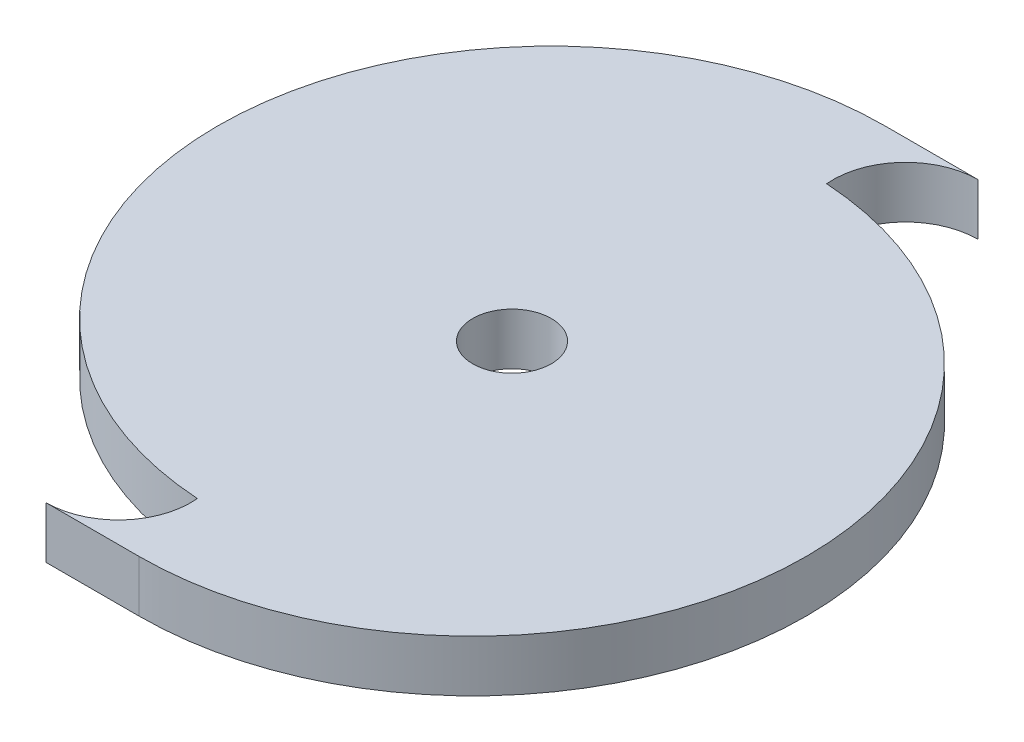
ISO-10303-21;
HEADER;
FILE_DESCRIPTION(('STEP AP214'),'2;1');
FILE_NAME('part.step','',(''),(''),'','','');
FILE_SCHEMA(('AUTOMOTIVE_DESIGN { 1 0 10303 214 1 1 1 1 }'));
ENDSEC;
DATA;
#1=APPLICATION_CONTEXT('core data for automotive mechanical design processes');
#2=APPLICATION_PROTOCOL_DEFINITION('international standard','automotive_design',2000,#1);
#3=PRODUCT_CONTEXT('',#1,'mechanical');
#4=PRODUCT('Part','Part','',(#3));
#5=PRODUCT_RELATED_PRODUCT_CATEGORY('part','',(#4));
#6=PRODUCT_DEFINITION_FORMATION('','',#4);
#7=PRODUCT_DEFINITION_CONTEXT('part definition',#1,'design');
#8=PRODUCT_DEFINITION('design','',#6,#7);
#9=PRODUCT_DEFINITION_SHAPE('','',#8);
#10=(LENGTH_UNIT() NAMED_UNIT(*) SI_UNIT(.MILLI.,.METRE.));
#11=(NAMED_UNIT(*) PLANE_ANGLE_UNIT() SI_UNIT($,.RADIAN.));
#12=(NAMED_UNIT(*) SI_UNIT($,.STERADIAN.) SOLID_ANGLE_UNIT());
#13=UNCERTAINTY_MEASURE_WITH_UNIT(LENGTH_MEASURE(1.E-05),#10,'distance_accuracy_value','');
#14=(GEOMETRIC_REPRESENTATION_CONTEXT(3) GLOBAL_UNCERTAINTY_ASSIGNED_CONTEXT((#13)) GLOBAL_UNIT_ASSIGNED_CONTEXT((#10,
#11,#12)) REPRESENTATION_CONTEXT('',''));
#15=CARTESIAN_POINT('',(0.,0.,0.));
#16=DIRECTION('',(0.,0.,1.));
#17=DIRECTION('',(1.,0.,0.));
#18=AXIS2_PLACEMENT_3D('',#15,#16,#17);
#19=CARTESIAN_POINT('',(18.,10.,-58.1));
#20=DIRECTION('',(0.,1.,0.));
#21=DIRECTION('',(0.,0.,1.));
#22=AXIS2_PLACEMENT_3D('',#19,#20,#21);
#23=PLANE('',#22);
#24=CARTESIAN_POINT('',(18.,10.,-58.1));
#25=DIRECTION('',(0.,-1.,0.));
#26=DIRECTION('',(0.,0.,1.));
#27=AXIS2_PLACEMENT_3D('',#24,#25,#26);
#28=CIRCLE('',#27,14.);
#29=CARTESIAN_POINT('',(4.06313743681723,10.,-56.7718953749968));
#30=VERTEX_POINT('',#29);
#31=CARTESIAN_POINT('',(18.,10.,-72.1));
#32=VERTEX_POINT('',#31);
#33=EDGE_CURVE('E129',#30,#32,#28,.T.);
#34=ORIENTED_EDGE('',*,*,#33,.T.);
#35=DIRECTION('',(-1.,0.,0.));
#36=VECTOR('',#35,1.);
#37=CARTESIAN_POINT('',(0.,10.,-72.1));
#38=LINE('',#37,#36);
#39=CARTESIAN_POINT('',(0.,10.,-72.1));
#40=VERTEX_POINT('',#39);
#41=EDGE_CURVE('E87',#32,#40,#38,.T.);
#42=ORIENTED_EDGE('',*,*,#41,.T.);
#43=CARTESIAN_POINT('',(0.,10.,-7.6));
#44=DIRECTION('',(0.,1.,0.));
#45=DIRECTION('',(0.,0.,1.));
#46=AXIS2_PLACEMENT_3D('',#43,#44,#45);
#47=CIRCLE('',#46,64.5);
#48=CARTESIAN_POINT('',(-4.06313743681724,10.,56.7718953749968));
#49=VERTEX_POINT('',#48);
#50=EDGE_CURVE('E100',#40,#49,#47,.T.);
#51=ORIENTED_EDGE('',*,*,#50,.T.);
#52=CARTESIAN_POINT('',(-18.,10.,58.1));
#53=DIRECTION('',(0.,-1.,0.));
#54=DIRECTION('',(0.,0.,1.));
#55=AXIS2_PLACEMENT_3D('',#52,#53,#54);
#56=CIRCLE('',#55,14.);
#57=CARTESIAN_POINT('',(-18.,10.,72.1));
#58=VERTEX_POINT('',#57);
#59=EDGE_CURVE('E94',#49,#58,#56,.T.);
#60=ORIENTED_EDGE('',*,*,#59,.T.);
#61=DIRECTION('',(1.,0.,0.));
#62=VECTOR('',#61,1.);
#63=CARTESIAN_POINT('',(0.,10.,72.1));
#64=LINE('',#63,#62);
#65=CARTESIAN_POINT('',(0.,10.,72.1));
#66=VERTEX_POINT('',#65);
#67=EDGE_CURVE('E98',#58,#66,#64,.T.);
#68=ORIENTED_EDGE('',*,*,#67,.T.);
#69=CARTESIAN_POINT('',(0.,10.,7.6));
#70=DIRECTION('',(0.,1.,0.));
#71=DIRECTION('',(0.,0.,1.));
#72=AXIS2_PLACEMENT_3D('',#69,#70,#71);
#73=CIRCLE('',#72,64.5);
#74=EDGE_CURVE('E50',#66,#30,#73,.T.);
#75=ORIENTED_EDGE('',*,*,#74,.T.);
#76=EDGE_LOOP('',(#34,#42,#51,#60,#68,#75));
#77=FACE_BOUND('',#76,.T.);
#78=CARTESIAN_POINT('',(0.,10.,0.));
#79=DIRECTION('',(0.,1.,0.));
#80=DIRECTION('',(0.,0.,1.));
#81=AXIS2_PLACEMENT_3D('',#78,#79,#80);
#82=CIRCLE('',#81,7.6);
#83=CARTESIAN_POINT('',(0.,10.,7.6));
#84=VERTEX_POINT('',#83);
#85=EDGE_CURVE('E122',#84,#84,#82,.T.);
#86=ORIENTED_EDGE('',*,*,#85,.F.);
#87=EDGE_LOOP('',(#86));
#88=FACE_BOUND('',#87,.T.);
#89=ADVANCED_FACE('F33',(#77,#88),#23,.T.);
#90=CARTESIAN_POINT('',(18.,0.,-58.1));
#91=DIRECTION('',(0.,1.,0.));
#92=DIRECTION('',(0.,0.,1.));
#93=AXIS2_PLACEMENT_3D('',#90,#91,#92);
#94=PLANE('',#93);
#95=CARTESIAN_POINT('',(18.,0.,-58.1));
#96=DIRECTION('',(0.,-1.,0.));
#97=DIRECTION('',(0.,0.,1.));
#98=AXIS2_PLACEMENT_3D('',#95,#96,#97);
#99=CIRCLE('',#98,14.);
#100=CARTESIAN_POINT('',(4.06313743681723,0.,-56.7718953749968));
#101=VERTEX_POINT('',#100);
#102=CARTESIAN_POINT('',(18.,0.,-72.1));
#103=VERTEX_POINT('',#102);
#104=EDGE_CURVE('E118',#101,#103,#99,.T.);
#105=ORIENTED_EDGE('',*,*,#104,.F.);
#106=CARTESIAN_POINT('',(0.,0.,7.6));
#107=DIRECTION('',(0.,1.,0.));
#108=DIRECTION('',(0.,0.,1.));
#109=AXIS2_PLACEMENT_3D('',#106,#107,#108);
#110=CIRCLE('',#109,64.5);
#111=CARTESIAN_POINT('',(0.,0.,72.1));
#112=VERTEX_POINT('',#111);
#113=EDGE_CURVE('E79',#112,#101,#110,.T.);
#114=ORIENTED_EDGE('',*,*,#113,.F.);
#115=DIRECTION('',(1.,0.,0.));
#116=VECTOR('',#115,1.);
#117=CARTESIAN_POINT('',(0.,0.,72.1));
#118=LINE('',#117,#116);
#119=CARTESIAN_POINT('',(-18.,0.,72.1));
#120=VERTEX_POINT('',#119);
#121=EDGE_CURVE('E73',#120,#112,#118,.T.);
#122=ORIENTED_EDGE('',*,*,#121,.F.);
#123=CARTESIAN_POINT('',(-18.,0.,58.1));
#124=DIRECTION('',(0.,-1.,0.));
#125=DIRECTION('',(0.,0.,1.));
#126=AXIS2_PLACEMENT_3D('',#123,#124,#125);
#127=CIRCLE('',#126,14.);
#128=CARTESIAN_POINT('',(-4.06313743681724,0.,56.7718953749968));
#129=VERTEX_POINT('',#128);
#130=EDGE_CURVE('E108',#129,#120,#127,.T.);
#131=ORIENTED_EDGE('',*,*,#130,.F.);
#132=CARTESIAN_POINT('',(0.,0.,-7.6));
#133=DIRECTION('',(0.,1.,0.));
#134=DIRECTION('',(0.,0.,1.));
#135=AXIS2_PLACEMENT_3D('',#132,#133,#134);
#136=CIRCLE('',#135,64.5);
#137=CARTESIAN_POINT('',(0.,0.,-72.1));
#138=VERTEX_POINT('',#137);
#139=EDGE_CURVE('E124',#138,#129,#136,.T.);
#140=ORIENTED_EDGE('',*,*,#139,.F.);
#141=DIRECTION('',(-1.,0.,0.));
#142=VECTOR('',#141,1.);
#143=CARTESIAN_POINT('',(0.,0.,-72.1));
#144=LINE('',#143,#142);
#145=EDGE_CURVE('E121',#103,#138,#144,.T.);
#146=ORIENTED_EDGE('',*,*,#145,.F.);
#147=EDGE_LOOP('',(#105,#114,#122,#131,#140,#146));
#148=FACE_BOUND('',#147,.T.);
#149=CARTESIAN_POINT('',(0.,0.,0.));
#150=DIRECTION('',(0.,1.,0.));
#151=DIRECTION('',(0.,0.,1.));
#152=AXIS2_PLACEMENT_3D('',#149,#150,#151);
#153=CIRCLE('',#152,7.6);
#154=CARTESIAN_POINT('',(0.,0.,7.6));
#155=VERTEX_POINT('',#154);
#156=EDGE_CURVE('E222',#155,#155,#153,.T.);
#157=ORIENTED_EDGE('',*,*,#156,.T.);
#158=EDGE_LOOP('',(#157));
#159=FACE_BOUND('',#158,.T.);
#160=ADVANCED_FACE('F138',(#148,#159),#94,.F.);
#161=CARTESIAN_POINT('',(18.,10.,-58.1));
#162=DIRECTION('',(0.,-1.,0.));
#163=DIRECTION('',(0.,0.,-1.));
#164=AXIS2_PLACEMENT_3D('',#161,#162,#163);
#165=CYLINDRICAL_SURFACE('',#164,14.);
#166=ORIENTED_EDGE('',*,*,#104,.T.);
#167=DIRECTION('',(0.,-1.,0.));
#168=VECTOR('',#167,1.);
#169=CARTESIAN_POINT('',(18.,10.,-72.1));
#170=LINE('',#169,#168);
#171=EDGE_CURVE('E11',#32,#103,#170,.T.);
#172=ORIENTED_EDGE('',*,*,#171,.F.);
#173=ORIENTED_EDGE('',*,*,#33,.F.);
#174=DIRECTION('',(0.,-1.,0.));
#175=VECTOR('',#174,1.);
#176=CARTESIAN_POINT('',(4.06313743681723,10.,-56.7718953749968));
#177=LINE('',#176,#175);
#178=EDGE_CURVE('E114',#30,#101,#177,.T.);
#179=ORIENTED_EDGE('',*,*,#178,.T.);
#180=EDGE_LOOP('',(#166,#172,#173,#179));
#181=FACE_BOUND('',#180,.T.);
#182=ADVANCED_FACE('F35',(#181),#165,.F.);
#183=CARTESIAN_POINT('',(0.,10.,-72.1));
#184=DIRECTION('',(0.,0.,1.));
#185=DIRECTION('',(1.,0.,0.));
#186=AXIS2_PLACEMENT_3D('',#183,#184,#185);
#187=PLANE('',#186);
#188=ORIENTED_EDGE('',*,*,#145,.T.);
#189=DIRECTION('',(0.,-1.,0.));
#190=VECTOR('',#189,1.);
#191=CARTESIAN_POINT('',(0.,10.,-72.1));
#192=LINE('',#191,#190);
#193=EDGE_CURVE('E42',#40,#138,#192,.T.);
#194=ORIENTED_EDGE('',*,*,#193,.F.);
#195=ORIENTED_EDGE('',*,*,#41,.F.);
#196=ORIENTED_EDGE('',*,*,#171,.T.);
#197=EDGE_LOOP('',(#188,#194,#195,#196));
#198=FACE_BOUND('',#197,.T.);
#199=ADVANCED_FACE('F163',(#198),#187,.F.);
#200=CARTESIAN_POINT('',(0.,10.,-7.6));
#201=DIRECTION('',(0.,-1.,0.));
#202=DIRECTION('',(0.,0.,-1.));
#203=AXIS2_PLACEMENT_3D('',#200,#201,#202);
#204=CYLINDRICAL_SURFACE('',#203,64.5);
#205=ORIENTED_EDGE('',*,*,#139,.T.);
#206=DIRECTION('',(0.,-1.,0.));
#207=VECTOR('',#206,1.);
#208=CARTESIAN_POINT('',(-4.06313743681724,10.,56.7718953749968));
#209=LINE('',#208,#207);
#210=EDGE_CURVE('E109',#49,#129,#209,.T.);
#211=ORIENTED_EDGE('',*,*,#210,.F.);
#212=ORIENTED_EDGE('',*,*,#50,.F.);
#213=ORIENTED_EDGE('',*,*,#193,.T.);
#214=EDGE_LOOP('',(#205,#211,#212,#213));
#215=FACE_BOUND('',#214,.T.);
#216=ADVANCED_FACE('F135',(#215),#204,.T.);
#217=CARTESIAN_POINT('',(-18.,10.,58.1));
#218=DIRECTION('',(0.,-1.,0.));
#219=DIRECTION('',(0.,0.,-1.));
#220=AXIS2_PLACEMENT_3D('',#217,#218,#219);
#221=CYLINDRICAL_SURFACE('',#220,14.);
#222=ORIENTED_EDGE('',*,*,#130,.T.);
#223=DIRECTION('',(0.,-1.,0.));
#224=VECTOR('',#223,1.);
#225=CARTESIAN_POINT('',(-18.,10.,72.1));
#226=LINE('',#225,#224);
#227=EDGE_CURVE('E105',#58,#120,#226,.T.);
#228=ORIENTED_EDGE('',*,*,#227,.F.);
#229=ORIENTED_EDGE('',*,*,#59,.F.);
#230=ORIENTED_EDGE('',*,*,#210,.T.);
#231=EDGE_LOOP('',(#222,#228,#229,#230));
#232=FACE_BOUND('',#231,.T.);
#233=ADVANCED_FACE('F106',(#232),#221,.F.);
#234=CARTESIAN_POINT('',(0.,10.,72.1));
#235=DIRECTION('',(0.,0.,-1.));
#236=DIRECTION('',(-1.,0.,0.));
#237=AXIS2_PLACEMENT_3D('',#234,#235,#236);
#238=PLANE('',#237);
#239=ORIENTED_EDGE('',*,*,#121,.T.);
#240=DIRECTION('',(0.,-1.,0.));
#241=VECTOR('',#240,1.);
#242=CARTESIAN_POINT('',(0.,10.,72.1));
#243=LINE('',#242,#241);
#244=EDGE_CURVE('E110',#66,#112,#243,.T.);
#245=ORIENTED_EDGE('',*,*,#244,.F.);
#246=ORIENTED_EDGE('',*,*,#67,.F.);
#247=ORIENTED_EDGE('',*,*,#227,.T.);
#248=EDGE_LOOP('',(#239,#245,#246,#247));
#249=FACE_BOUND('',#248,.T.);
#250=ADVANCED_FACE('F112',(#249),#238,.F.);
#251=CARTESIAN_POINT('',(0.,10.,7.6));
#252=DIRECTION('',(0.,-1.,0.));
#253=DIRECTION('',(0.,0.,-1.));
#254=AXIS2_PLACEMENT_3D('',#251,#252,#253);
#255=CYLINDRICAL_SURFACE('',#254,64.5);
#256=ORIENTED_EDGE('',*,*,#113,.T.);
#257=ORIENTED_EDGE('',*,*,#178,.F.);
#258=ORIENTED_EDGE('',*,*,#74,.F.);
#259=ORIENTED_EDGE('',*,*,#244,.T.);
#260=EDGE_LOOP('',(#256,#257,#258,#259));
#261=FACE_BOUND('',#260,.T.);
#262=ADVANCED_FACE('F143',(#261),#255,.T.);
#263=CARTESIAN_POINT('',(0.,10.,0.));
#264=DIRECTION('',(0.,-1.,0.));
#265=DIRECTION('',(0.,0.,-1.));
#266=AXIS2_PLACEMENT_3D('',#263,#264,#265);
#267=CYLINDRICAL_SURFACE('',#266,7.6);
#268=ORIENTED_EDGE('',*,*,#85,.T.);
#269=EDGE_LOOP('',(#268));
#270=FACE_BOUND('',#269,.T.);
#271=ORIENTED_EDGE('',*,*,#156,.F.);
#272=EDGE_LOOP('',(#271));
#273=FACE_BOUND('',#272,.T.);
#274=ADVANCED_FACE('F145',(#270,#273),#267,.F.);
#275=CLOSED_SHELL('',(#89,#160,#182,#199,#216,#233,#250,#262,#274));
#276=MANIFOLD_SOLID_BREP('B2',#275);
#277=ADVANCED_BREP_SHAPE_REPRESENTATION('',(#18,#276),#14);
#278=SHAPE_DEFINITION_REPRESENTATION(#9,#277);
ENDSEC;
END-ISO-10303-21;
